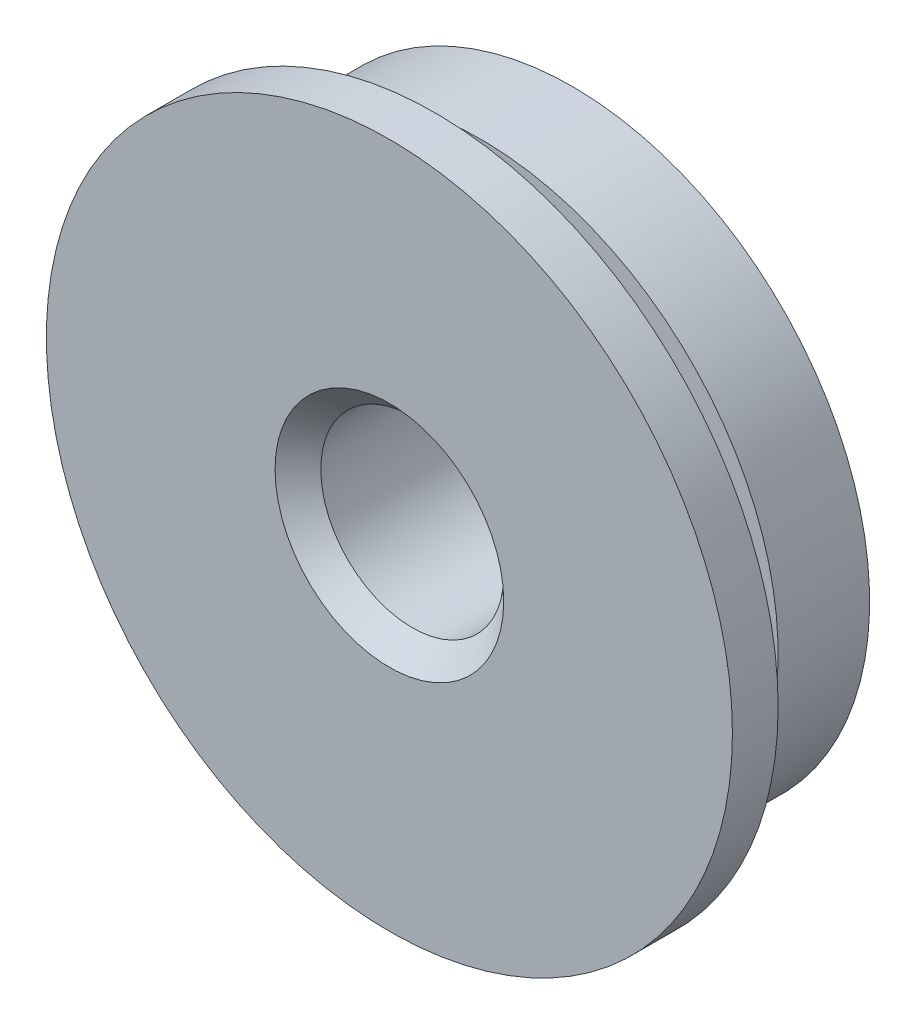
from build123d import *

# Parameters (mm, degrees)
SKETCH1_R           = 15
BOSS_EXTRUDE1_DEPTH = 2
SKETCH2_R           = 12
BOSS_EXTRUDE2_DEPTH = 2
SKETCH5_R           = 13
BOSS_EXTRUDE4_DEPTH = 4
SKETCH3_R           = 4
CUT_EXTRUDE1_DEPTH  = 10
CHAMFER1_SIZE       = 1


with BuildPart() as part:
    # Sketch1 → Boss-Extrude1 (new body)
    with BuildSketch(Plane.XY):
        Circle(SKETCH1_R)
    extrude(amount=-BOSS_EXTRUDE1_DEPTH)

    # Sketch2 → Boss-Extrude2 (add)
    with BuildSketch(Plane(origin=(0, 0, -2), x_dir=(-1, 0, 0), z_dir=(0, 0, -1))):
        with Locations(Location((0, 0, 0), (0, 0, 180))):
            Circle(SKETCH2_R)
    extrude(amount=BOSS_EXTRUDE2_DEPTH)

    # Sketch5 → Boss-Extrude4 (add)
    with BuildSketch(Plane(origin=(0, 0, -4), x_dir=(-1, 0, 0), z_dir=(0, 0, -1))):
        Circle(SKETCH5_R)
    extrude(amount=BOSS_EXTRUDE4_DEPTH)

    # Sketch3 → Cut-Extrude1 (cut)
    with BuildSketch(Plane.XY):
        Circle(SKETCH3_R)
    extrude(amount=-CUT_EXTRUDE1_DEPTH, mode=Mode.SUBTRACT)

    # Chamfer1
    chamfer1_edges = [part.edges().sort_by_distance(p)[0] for p in [
        (-4, 0, -8),
        (-4, 0, 0),
    ]]
    chamfer(chamfer1_edges, length=CHAMFER1_SIZE)


solid = part.part
